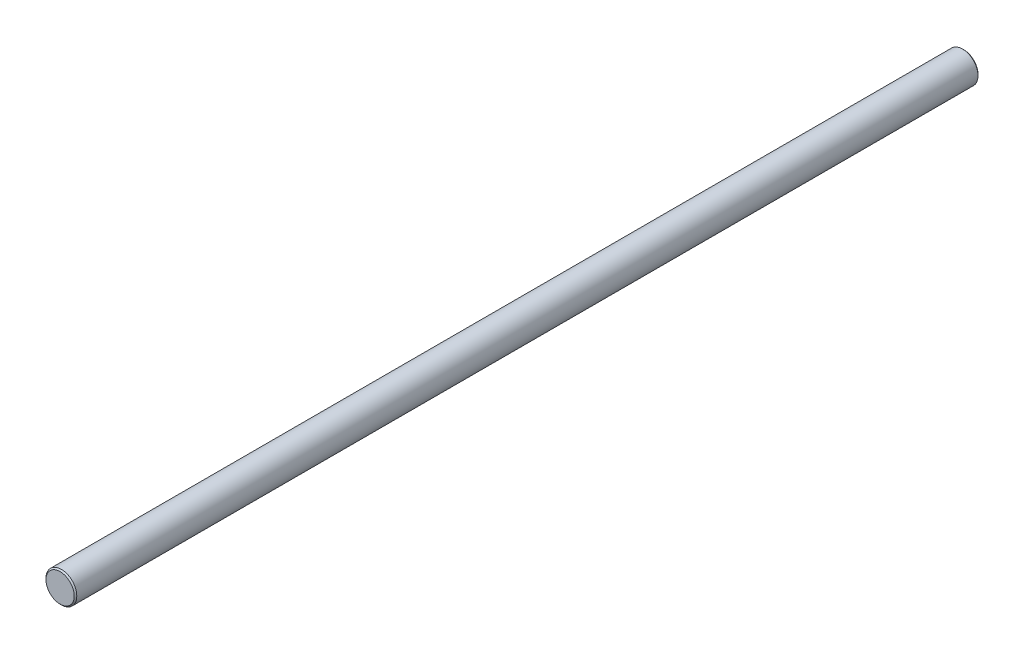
ISO-10303-21;
HEADER;
FILE_DESCRIPTION(('STEP AP214'),'2;1');
FILE_NAME('part.step','',(''),(''),'','','');
FILE_SCHEMA(('AUTOMOTIVE_DESIGN { 1 0 10303 214 1 1 1 1 }'));
ENDSEC;
DATA;
#1=APPLICATION_CONTEXT('core data for automotive mechanical design processes');
#2=APPLICATION_PROTOCOL_DEFINITION('international standard','automotive_design',2000,#1);
#3=PRODUCT_CONTEXT('',#1,'mechanical');
#4=PRODUCT('Part','Part','',(#3));
#5=PRODUCT_RELATED_PRODUCT_CATEGORY('part','',(#4));
#6=PRODUCT_DEFINITION_FORMATION('','',#4);
#7=PRODUCT_DEFINITION_CONTEXT('part definition',#1,'design');
#8=PRODUCT_DEFINITION('design','',#6,#7);
#9=PRODUCT_DEFINITION_SHAPE('','',#8);
#10=(LENGTH_UNIT() NAMED_UNIT(*) SI_UNIT(.MILLI.,.METRE.));
#11=(NAMED_UNIT(*) PLANE_ANGLE_UNIT() SI_UNIT($,.RADIAN.));
#12=(NAMED_UNIT(*) SI_UNIT($,.STERADIAN.) SOLID_ANGLE_UNIT());
#13=UNCERTAINTY_MEASURE_WITH_UNIT(LENGTH_MEASURE(1.E-05),#10,'distance_accuracy_value','');
#14=(GEOMETRIC_REPRESENTATION_CONTEXT(3) GLOBAL_UNCERTAINTY_ASSIGNED_CONTEXT((#13)) GLOBAL_UNIT_ASSIGNED_CONTEXT((#10,
#11,#12)) REPRESENTATION_CONTEXT('',''));
#15=CARTESIAN_POINT('',(0.,0.,0.));
#16=DIRECTION('',(0.,0.,1.));
#17=DIRECTION('',(1.,0.,0.));
#18=AXIS2_PLACEMENT_3D('',#15,#16,#17);
#19=CARTESIAN_POINT('',(0.,0.,279.4));
#20=DIRECTION('',(0.,0.,-1.));
#21=DIRECTION('',(-1.,0.,0.));
#22=AXIS2_PLACEMENT_3D('',#19,#20,#21);
#23=CYLINDRICAL_SURFACE('',#22,9.525);
#24=CARTESIAN_POINT('',(0.,0.,-278.60625));
#25=DIRECTION('',(0.,0.,1.));
#26=DIRECTION('',(1.,0.,0.));
#27=AXIS2_PLACEMENT_3D('',#24,#25,#26);
#28=CIRCLE('',#27,9.525);
#29=CARTESIAN_POINT('',(9.525,0.,-278.60625));
#30=VERTEX_POINT('',#29);
#31=EDGE_CURVE('E38',#30,#30,#28,.T.);
#32=ORIENTED_EDGE('',*,*,#31,.T.);
#33=EDGE_LOOP('',(#32));
#34=FACE_BOUND('',#33,.T.);
#35=CARTESIAN_POINT('',(0.,0.,278.60625));
#36=DIRECTION('',(0.,0.,1.));
#37=DIRECTION('',(1.,0.,0.));
#38=AXIS2_PLACEMENT_3D('',#35,#36,#37);
#39=CIRCLE('',#38,9.525);
#40=CARTESIAN_POINT('',(9.525,0.,278.60625));
#41=VERTEX_POINT('',#40);
#42=EDGE_CURVE('E42',#41,#41,#39,.F.);
#43=ORIENTED_EDGE('',*,*,#42,.T.);
#44=EDGE_LOOP('',(#43));
#45=FACE_BOUND('',#44,.T.);
#46=ADVANCED_FACE('F28',(#34,#45),#23,.T.);
#47=CARTESIAN_POINT('',(0.,0.,279.4));
#48=DIRECTION('',(0.,0.,1.));
#49=DIRECTION('',(1.,0.,0.));
#50=AXIS2_PLACEMENT_3D('',#47,#48,#49);
#51=PLANE('',#50);
#52=CARTESIAN_POINT('',(0.,0.,279.4));
#53=DIRECTION('',(0.,0.,1.));
#54=DIRECTION('',(1.,0.,0.));
#55=AXIS2_PLACEMENT_3D('',#52,#53,#54);
#56=CIRCLE('',#55,8.73125000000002);
#57=CARTESIAN_POINT('',(8.73125000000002,0.,279.4));
#58=VERTEX_POINT('',#57);
#59=EDGE_CURVE('E10',#58,#58,#56,.T.);
#60=ORIENTED_EDGE('',*,*,#59,.T.);
#61=EDGE_LOOP('',(#60));
#62=FACE_BOUND('',#61,.T.);
#63=ADVANCED_FACE('F61',(#62),#51,.T.);
#64=CARTESIAN_POINT('',(0.,0.,-279.4));
#65=DIRECTION('',(0.,0.,1.));
#66=DIRECTION('',(1.,0.,0.));
#67=AXIS2_PLACEMENT_3D('',#64,#65,#66);
#68=PLANE('',#67);
#69=CARTESIAN_POINT('',(0.,0.,-279.4));
#70=DIRECTION('',(0.,0.,1.));
#71=DIRECTION('',(1.,0.,0.));
#72=AXIS2_PLACEMENT_3D('',#69,#70,#71);
#73=CIRCLE('',#72,8.73124999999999);
#74=CARTESIAN_POINT('',(8.73124999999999,0.,-279.4));
#75=VERTEX_POINT('',#74);
#76=EDGE_CURVE('E34',#75,#75,#73,.F.);
#77=ORIENTED_EDGE('',*,*,#76,.T.);
#78=EDGE_LOOP('',(#77));
#79=FACE_BOUND('',#78,.T.);
#80=ADVANCED_FACE('F57',(#79),#68,.F.);
#81=CARTESIAN_POINT('',(0.,0.,-278.60625));
#82=DIRECTION('',(0.,0.,1.));
#83=DIRECTION('',(1.,0.,0.));
#84=AXIS2_PLACEMENT_3D('',#81,#82,#83);
#85=CONICAL_SURFACE('',#84,9.525,0.78539816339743);
#86=ORIENTED_EDGE('',*,*,#76,.F.);
#87=EDGE_LOOP('',(#86));
#88=FACE_BOUND('',#87,.T.);
#89=ORIENTED_EDGE('',*,*,#31,.F.);
#90=EDGE_LOOP('',(#89));
#91=FACE_BOUND('',#90,.T.);
#92=ADVANCED_FACE('F52',(#88,#91),#85,.T.);
#93=CARTESIAN_POINT('',(0.,0.,279.4));
#94=DIRECTION('',(0.,0.,-1.));
#95=DIRECTION('',(-1.,0.,0.));
#96=AXIS2_PLACEMENT_3D('',#93,#94,#95);
#97=CONICAL_SURFACE('',#96,8.73125000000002,0.785398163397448);
#98=ORIENTED_EDGE('',*,*,#42,.F.);
#99=EDGE_LOOP('',(#98));
#100=FACE_BOUND('',#99,.T.);
#101=ORIENTED_EDGE('',*,*,#59,.F.);
#102=EDGE_LOOP('',(#101));
#103=FACE_BOUND('',#102,.T.);
#104=ADVANCED_FACE('F49',(#100,#103),#97,.T.);
#105=CLOSED_SHELL('',(#46,#63,#80,#92,#104));
#106=MANIFOLD_SOLID_BREP('B2',#105);
#107=ADVANCED_BREP_SHAPE_REPRESENTATION('',(#18,#106),#14);
#108=SHAPE_DEFINITION_REPRESENTATION(#9,#107);
ENDSEC;
END-ISO-10303-21;
